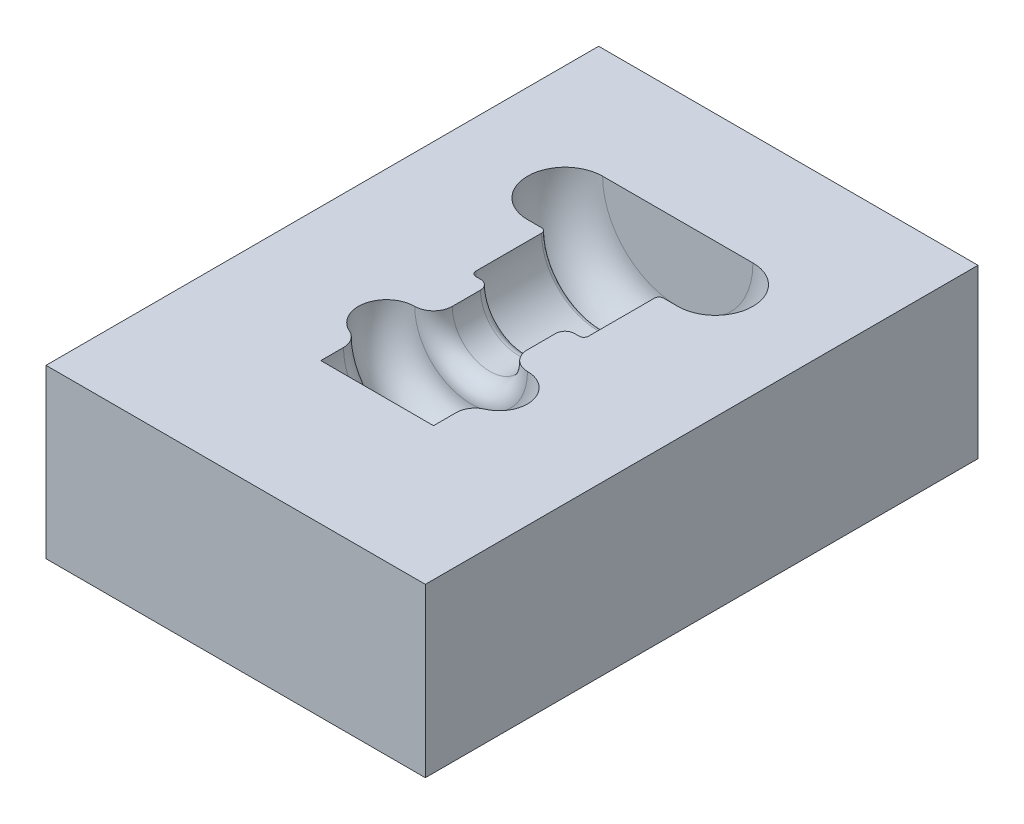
ISO-10303-21;
HEADER;
FILE_DESCRIPTION(('STEP AP214'),'2;1');
FILE_NAME('part.step','',(''),(''),'','','');
FILE_SCHEMA(('AUTOMOTIVE_DESIGN { 1 0 10303 214 1 1 1 1 }'));
ENDSEC;
DATA;
#1=APPLICATION_CONTEXT('core data for automotive mechanical design processes');
#2=APPLICATION_PROTOCOL_DEFINITION('international standard','automotive_design',2000,#1);
#3=PRODUCT_CONTEXT('',#1,'mechanical');
#4=PRODUCT('Part','Part','',(#3));
#5=PRODUCT_RELATED_PRODUCT_CATEGORY('part','',(#4));
#6=PRODUCT_DEFINITION_FORMATION('','',#4);
#7=PRODUCT_DEFINITION_CONTEXT('part definition',#1,'design');
#8=PRODUCT_DEFINITION('design','',#6,#7);
#9=PRODUCT_DEFINITION_SHAPE('','',#8);
#10=(LENGTH_UNIT() NAMED_UNIT(*) SI_UNIT(.MILLI.,.METRE.));
#11=(NAMED_UNIT(*) PLANE_ANGLE_UNIT() SI_UNIT($,.RADIAN.));
#12=(NAMED_UNIT(*) SI_UNIT($,.STERADIAN.) SOLID_ANGLE_UNIT());
#13=UNCERTAINTY_MEASURE_WITH_UNIT(LENGTH_MEASURE(1.E-05),#10,'distance_accuracy_value','');
#14=(GEOMETRIC_REPRESENTATION_CONTEXT(3) GLOBAL_UNCERTAINTY_ASSIGNED_CONTEXT((#13)) GLOBAL_UNIT_ASSIGNED_CONTEXT((#10,
#11,#12)) REPRESENTATION_CONTEXT('',''));
#15=CARTESIAN_POINT('',(0.,0.,0.));
#16=DIRECTION('',(0.,0.,1.));
#17=DIRECTION('',(1.,0.,0.));
#18=AXIS2_PLACEMENT_3D('',#15,#16,#17);
#19=CARTESIAN_POINT('',(-127.309952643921,0.,-0.01000000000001));
#20=DIRECTION('',(0.,-1.,0.));
#21=DIRECTION('',(0.,0.,-1.));
#22=AXIS2_PLACEMENT_3D('',#19,#20,#21);
#23=PLANE('',#22);
#24=CARTESIAN_POINT('',(40.8,0.,80.4000000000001));
#25=DIRECTION('',(0.,-1.,0.));
#26=DIRECTION('',(0.,0.,-1.));
#27=AXIS2_PLACEMENT_3D('',#24,#25,#26);
#28=CIRCLE('',#27,20.4);
#29=CARTESIAN_POINT('',(40.8,0.,100.8));
#30=VERTEX_POINT('',#29);
#31=CARTESIAN_POINT('',(40.8,0.,60.0000000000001));
#32=VERTEX_POINT('',#31);
#33=EDGE_CURVE('E221',#30,#32,#28,.F.);
#34=ORIENTED_EDGE('',*,*,#33,.F.);
#35=DIRECTION('',(1.,0.,0.));
#36=VECTOR('',#35,1.);
#37=CARTESIAN_POINT('',(40.8,0.,100.8));
#38=LINE('',#37,#36);
#39=CARTESIAN_POINT('',(33.15,0.,100.8));
#40=VERTEX_POINT('',#39);
#41=EDGE_CURVE('E218',#40,#30,#38,.T.);
#42=ORIENTED_EDGE('',*,*,#41,.F.);
#43=CARTESIAN_POINT('',(33.15,0.,103.35));
#44=DIRECTION('',(0.,-1.,0.));
#45=DIRECTION('',(0.,0.,-1.));
#46=AXIS2_PLACEMENT_3D('',#43,#44,#45);
#47=CIRCLE('',#46,2.55);
#48=CARTESIAN_POINT('',(30.6,0.,103.35));
#49=VERTEX_POINT('',#48);
#50=EDGE_CURVE('E214',#49,#40,#47,.T.);
#51=ORIENTED_EDGE('',*,*,#50,.F.);
#52=DIRECTION('',(0.,0.,-1.));
#53=VECTOR('',#52,1.);
#54=CARTESIAN_POINT('',(30.6,0.,60.0000000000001));
#55=LINE('',#54,#53);
#56=CARTESIAN_POINT('',(30.6,0.,139.05));
#57=VERTEX_POINT('',#56);
#58=EDGE_CURVE('E210',#57,#49,#55,.T.);
#59=ORIENTED_EDGE('',*,*,#58,.F.);
#60=CARTESIAN_POINT('',(28.05,0.,139.05));
#61=DIRECTION('',(0.,-1.,0.));
#62=DIRECTION('',(0.,0.,-1.));
#63=AXIS2_PLACEMENT_3D('',#60,#61,#62);
#64=CIRCLE('',#63,2.55);
#65=CARTESIAN_POINT('',(28.05,0.,141.6));
#66=VERTEX_POINT('',#65);
#67=EDGE_CURVE('E206',#66,#57,#64,.F.);
#68=ORIENTED_EDGE('',*,*,#67,.F.);
#69=DIRECTION('',(1.,0.,0.));
#70=VECTOR('',#69,1.);
#71=CARTESIAN_POINT('',(28.05,0.,141.6));
#72=LINE('',#71,#70);
#73=CARTESIAN_POINT('',(25.5,0.,141.6));
#74=VERTEX_POINT('',#73);
#75=EDGE_CURVE('E203',#74,#66,#72,.T.);
#76=ORIENTED_EDGE('',*,*,#75,.F.);
#77=CARTESIAN_POINT('',(25.5,0.,146.7));
#78=DIRECTION('',(0.,-1.,0.));
#79=DIRECTION('',(0.,0.,-1.));
#80=AXIS2_PLACEMENT_3D('',#77,#78,#79);
#81=CIRCLE('',#80,5.1);
#82=CARTESIAN_POINT('',(20.4,0.,146.7));
#83=VERTEX_POINT('',#82);
#84=EDGE_CURVE('E199',#83,#74,#81,.T.);
#85=ORIENTED_EDGE('',*,*,#84,.F.);
#86=DIRECTION('',(0.,0.,-1.));
#87=VECTOR('',#86,1.);
#88=CARTESIAN_POINT('',(20.4,0.,60.0000000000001));
#89=LINE('',#88,#87);
#90=CARTESIAN_POINT('',(20.4,0.,162.));
#91=VERTEX_POINT('',#90);
#92=EDGE_CURVE('E195',#91,#83,#89,.T.);
#93=ORIENTED_EDGE('',*,*,#92,.F.);
#94=CARTESIAN_POINT('',(30.6,0.,162.));
#95=DIRECTION('',(0.,-1.,0.));
#96=DIRECTION('',(0.,0.,-1.));
#97=AXIS2_PLACEMENT_3D('',#94,#95,#96);
#98=CIRCLE('',#97,10.2);
#99=CARTESIAN_POINT('',(30.6,0.,172.2));
#100=VERTEX_POINT('',#99);
#101=EDGE_CURVE('E191',#100,#91,#98,.T.);
#102=ORIENTED_EDGE('',*,*,#101,.F.);
#103=CARTESIAN_POINT('',(30.6,0.,187.5));
#104=DIRECTION('',(0.,-1.,0.));
#105=DIRECTION('',(0.,0.,-1.));
#106=AXIS2_PLACEMENT_3D('',#103,#104,#105);
#107=CIRCLE('',#106,15.3);
#108=CARTESIAN_POINT('',(36.72,0.,201.522681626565));
#109=VERTEX_POINT('',#108);
#110=EDGE_CURVE('E187',#109,#100,#107,.F.);
#111=ORIENTED_EDGE('',*,*,#110,.F.);
#112=CARTESIAN_POINT('',(40.8,0.,210.871136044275));
#113=DIRECTION('',(0.,-1.,0.));
#114=DIRECTION('',(0.,0.,-1.));
#115=AXIS2_PLACEMENT_3D('',#112,#113,#114);
#116=CIRCLE('',#115,10.2);
#117=CARTESIAN_POINT('',(30.6,0.,210.871136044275));
#118=VERTEX_POINT('',#117);
#119=EDGE_CURVE('E183',#118,#109,#116,.T.);
#120=ORIENTED_EDGE('',*,*,#119,.F.);
#121=DIRECTION('',(0.,0.,-1.));
#122=VECTOR('',#121,1.);
#123=CARTESIAN_POINT('',(30.6,0.,60.0000000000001));
#124=LINE('',#123,#122);
#125=CARTESIAN_POINT('',(30.6,0.,223.2));
#126=VERTEX_POINT('',#125);
#127=EDGE_CURVE('E178',#126,#118,#124,.T.);
#128=ORIENTED_EDGE('',*,*,#127,.F.);
#129=DIRECTION('',(1.,0.,0.));
#130=VECTOR('',#129,1.);
#131=CARTESIAN_POINT('',(10.2,0.,223.2));
#132=LINE('',#131,#130);
#133=CARTESIAN_POINT('',(-30.6,0.,223.2));
#134=VERTEX_POINT('',#133);
#135=EDGE_CURVE('E163',#134,#126,#132,.T.);
#136=ORIENTED_EDGE('',*,*,#135,.F.);
#137=DIRECTION('',(0.,0.,-1.));
#138=VECTOR('',#137,1.);
#139=CARTESIAN_POINT('',(-30.6,0.,60.0000000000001));
#140=LINE('',#139,#138);
#141=CARTESIAN_POINT('',(-30.6,0.,210.871136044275));
#142=VERTEX_POINT('',#141);
#143=EDGE_CURVE('E181',#142,#134,#140,.F.);
#144=ORIENTED_EDGE('',*,*,#143,.F.);
#145=CARTESIAN_POINT('',(-40.8,0.,210.871136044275));
#146=DIRECTION('',(0.,-1.,0.));
#147=DIRECTION('',(0.,0.,-1.));
#148=AXIS2_PLACEMENT_3D('',#145,#146,#147);
#149=CIRCLE('',#148,10.2);
#150=CARTESIAN_POINT('',(-36.72,0.,201.522681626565));
#151=VERTEX_POINT('',#150);
#152=EDGE_CURVE('E185',#151,#142,#149,.T.);
#153=ORIENTED_EDGE('',*,*,#152,.F.);
#154=CARTESIAN_POINT('',(-30.6,0.,187.5));
#155=DIRECTION('',(0.,-1.,0.));
#156=DIRECTION('',(0.,0.,-1.));
#157=AXIS2_PLACEMENT_3D('',#154,#155,#156);
#158=CIRCLE('',#157,15.3);
#159=CARTESIAN_POINT('',(-30.6,0.,172.2));
#160=VERTEX_POINT('',#159);
#161=EDGE_CURVE('E189',#160,#151,#158,.F.);
#162=ORIENTED_EDGE('',*,*,#161,.F.);
#163=CARTESIAN_POINT('',(-30.6,0.,162.));
#164=DIRECTION('',(0.,-1.,0.));
#165=DIRECTION('',(0.,0.,-1.));
#166=AXIS2_PLACEMENT_3D('',#163,#164,#165);
#167=CIRCLE('',#166,10.2);
#168=CARTESIAN_POINT('',(-20.4,0.,162.));
#169=VERTEX_POINT('',#168);
#170=EDGE_CURVE('E193',#169,#160,#167,.T.);
#171=ORIENTED_EDGE('',*,*,#170,.F.);
#172=DIRECTION('',(0.,0.,-1.));
#173=VECTOR('',#172,1.);
#174=CARTESIAN_POINT('',(-20.4,0.,60.0000000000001));
#175=LINE('',#174,#173);
#176=CARTESIAN_POINT('',(-20.4,0.,146.7));
#177=VERTEX_POINT('',#176);
#178=EDGE_CURVE('E197',#177,#169,#175,.F.);
#179=ORIENTED_EDGE('',*,*,#178,.F.);
#180=CARTESIAN_POINT('',(-25.5,0.,146.7));
#181=DIRECTION('',(0.,-1.,0.));
#182=DIRECTION('',(0.,0.,-1.));
#183=AXIS2_PLACEMENT_3D('',#180,#181,#182);
#184=CIRCLE('',#183,5.1);
#185=CARTESIAN_POINT('',(-25.5,0.,141.6));
#186=VERTEX_POINT('',#185);
#187=EDGE_CURVE('E201',#186,#177,#184,.T.);
#188=ORIENTED_EDGE('',*,*,#187,.F.);
#189=CARTESIAN_POINT('',(-28.05,0.,141.6));
#190=VERTEX_POINT('',#189);
#191=EDGE_CURVE('E204',#190,#186,#72,.T.);
#192=ORIENTED_EDGE('',*,*,#191,.F.);
#193=CARTESIAN_POINT('',(-28.05,0.,139.05));
#194=DIRECTION('',(0.,-1.,0.));
#195=DIRECTION('',(0.,0.,-1.));
#196=AXIS2_PLACEMENT_3D('',#193,#194,#195);
#197=CIRCLE('',#196,2.55);
#198=CARTESIAN_POINT('',(-30.6,0.,139.05));
#199=VERTEX_POINT('',#198);
#200=EDGE_CURVE('E208',#199,#190,#197,.F.);
#201=ORIENTED_EDGE('',*,*,#200,.F.);
#202=DIRECTION('',(0.,0.,-1.));
#203=VECTOR('',#202,1.);
#204=CARTESIAN_POINT('',(-30.6,0.,60.0000000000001));
#205=LINE('',#204,#203);
#206=CARTESIAN_POINT('',(-30.6,0.,103.35));
#207=VERTEX_POINT('',#206);
#208=EDGE_CURVE('E212',#207,#199,#205,.F.);
#209=ORIENTED_EDGE('',*,*,#208,.F.);
#210=CARTESIAN_POINT('',(-33.15,0.,103.35));
#211=DIRECTION('',(0.,-1.,0.));
#212=DIRECTION('',(0.,0.,-1.));
#213=AXIS2_PLACEMENT_3D('',#210,#211,#212);
#214=CIRCLE('',#213,2.55);
#215=CARTESIAN_POINT('',(-33.15,0.,100.8));
#216=VERTEX_POINT('',#215);
#217=EDGE_CURVE('E216',#216,#207,#214,.T.);
#218=ORIENTED_EDGE('',*,*,#217,.F.);
#219=CARTESIAN_POINT('',(-40.8,0.,100.8));
#220=VERTEX_POINT('',#219);
#221=EDGE_CURVE('E219',#220,#216,#38,.T.);
#222=ORIENTED_EDGE('',*,*,#221,.F.);
#223=CARTESIAN_POINT('',(-40.8,0.,80.4000000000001));
#224=DIRECTION('',(0.,-1.,0.));
#225=DIRECTION('',(0.,0.,-1.));
#226=AXIS2_PLACEMENT_3D('',#223,#224,#225);
#227=CIRCLE('',#226,20.4);
#228=CARTESIAN_POINT('',(-40.8,0.,60.0000000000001));
#229=VERTEX_POINT('',#228);
#230=EDGE_CURVE('E224',#229,#220,#227,.F.);
#231=ORIENTED_EDGE('',*,*,#230,.F.);
#232=DIRECTION('',(-1.,0.,0.));
#233=VECTOR('',#232,1.);
#234=CARTESIAN_POINT('',(0.,0.,60.0000000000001));
#235=LINE('',#234,#233);
#236=EDGE_CURVE('E226',#32,#229,#235,.T.);
#237=ORIENTED_EDGE('',*,*,#236,.F.);
#238=EDGE_LOOP('',(#34,#42,#51,#59,#68,#76,#85,#93,#102,#111,#120,#128,#136,#144,#153,#162,#171,
#179,#188,#192,#201,#209,#218,#222,#231,#237));
#239=FACE_BOUND('',#238,.T.);
#240=DIRECTION('',(1.,0.,0.));
#241=VECTOR('',#240,1.);
#242=CARTESIAN_POINT('',(0.,0.,0.));
#243=LINE('',#242,#241);
#244=CARTESIAN_POINT('',(-102.966766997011,0.,0.));
#245=VERTEX_POINT('',#244);
#246=CARTESIAN_POINT('',(102.966766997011,0.,0.));
#247=VERTEX_POINT('',#246);
#248=EDGE_CURVE('E228',#245,#247,#243,.T.);
#249=ORIENTED_EDGE('',*,*,#248,.F.);
#250=DIRECTION('',(0.,0.,-1.));
#251=VECTOR('',#250,1.);
#252=CARTESIAN_POINT('',(-102.966766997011,0.,300.));
#253=LINE('',#252,#251);
#254=CARTESIAN_POINT('',(-102.966766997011,0.,300.));
#255=VERTEX_POINT('',#254);
#256=EDGE_CURVE('E230',#255,#245,#253,.T.);
#257=ORIENTED_EDGE('',*,*,#256,.F.);
#258=DIRECTION('',(1.,0.,0.));
#259=VECTOR('',#258,1.);
#260=CARTESIAN_POINT('',(0.,0.,300.));
#261=LINE('',#260,#259);
#262=CARTESIAN_POINT('',(102.966766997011,0.,300.));
#263=VERTEX_POINT('',#262);
#264=EDGE_CURVE('E11',#255,#263,#261,.T.);
#265=ORIENTED_EDGE('',*,*,#264,.T.);
#266=DIRECTION('',(0.,0.,1.));
#267=VECTOR('',#266,1.);
#268=CARTESIAN_POINT('',(102.966766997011,0.,300.));
#269=LINE('',#268,#267);
#270=EDGE_CURVE('E35',#247,#263,#269,.T.);
#271=ORIENTED_EDGE('',*,*,#270,.F.);
#272=EDGE_LOOP('',(#249,#257,#265,#271));
#273=FACE_BOUND('',#272,.T.);
#274=ADVANCED_FACE('F32',(#239,#273),#23,.F.);
#275=CARTESIAN_POINT('',(0.,0.,60.0000000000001));
#276=DIRECTION('',(0.,0.,-1.));
#277=DIRECTION('',(0.,1.,0.));
#278=AXIS2_PLACEMENT_3D('',#275,#276,#277);
#279=PLANE('',#278);
#280=CARTESIAN_POINT('',(0.,0.,60.0000000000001));
#281=DIRECTION('',(0.,0.,-1.));
#282=DIRECTION('',(0.,1.,0.));
#283=AXIS2_PLACEMENT_3D('',#280,#281,#282);
#284=CIRCLE('',#283,40.8);
#285=EDGE_CURVE('E174',#32,#229,#284,.T.);
#286=ORIENTED_EDGE('',*,*,#285,.F.);
#287=ORIENTED_EDGE('',*,*,#236,.T.);
#288=EDGE_LOOP('',(#286,#287));
#289=FACE_BOUND('',#288,.T.);
#290=ADVANCED_FACE('F341',(#289),#279,.F.);
#291=CARTESIAN_POINT('',(0.,0.,80.4000000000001));
#292=DIRECTION('',(0.,0.,-1.));
#293=DIRECTION('',(0.,1.,0.));
#294=AXIS2_PLACEMENT_3D('',#291,#292,#293);
#295=TOROIDAL_SURFACE('',#294,40.8,20.4);
#296=ORIENTED_EDGE('',*,*,#285,.T.);
#297=ORIENTED_EDGE('',*,*,#230,.T.);
#298=CARTESIAN_POINT('',(0.,0.,100.8));
#299=DIRECTION('',(0.,0.,-1.));
#300=DIRECTION('',(0.,1.,0.));
#301=AXIS2_PLACEMENT_3D('',#298,#299,#300);
#302=CIRCLE('',#301,40.8);
#303=EDGE_CURVE('E240',#30,#220,#302,.T.);
#304=ORIENTED_EDGE('',*,*,#303,.F.);
#305=ORIENTED_EDGE('',*,*,#33,.T.);
#306=EDGE_LOOP('',(#296,#297,#304,#305));
#307=FACE_BOUND('',#306,.T.);
#308=ADVANCED_FACE('F339',(#307),#295,.F.);
#309=CARTESIAN_POINT('',(40.8,0.,100.8));
#310=DIRECTION('',(0.,0.,1.));
#311=DIRECTION('',(0.,-1.,0.));
#312=AXIS2_PLACEMENT_3D('',#309,#310,#311);
#313=PLANE('',#312);
#314=ORIENTED_EDGE('',*,*,#303,.T.);
#315=ORIENTED_EDGE('',*,*,#221,.T.);
#316=CARTESIAN_POINT('',(0.,0.,100.8));
#317=DIRECTION('',(0.,0.,-1.));
#318=DIRECTION('',(0.,1.,0.));
#319=AXIS2_PLACEMENT_3D('',#316,#317,#318);
#320=CIRCLE('',#319,33.15);
#321=EDGE_CURVE('E243',#40,#216,#320,.T.);
#322=ORIENTED_EDGE('',*,*,#321,.F.);
#323=ORIENTED_EDGE('',*,*,#41,.T.);
#324=EDGE_LOOP('',(#314,#315,#322,#323));
#325=FACE_BOUND('',#324,.T.);
#326=ADVANCED_FACE('F334',(#325),#313,.F.);
#327=CARTESIAN_POINT('',(0.,0.,103.35));
#328=DIRECTION('',(0.,0.,-1.));
#329=DIRECTION('',(0.,1.,0.));
#330=AXIS2_PLACEMENT_3D('',#327,#328,#329);
#331=TOROIDAL_SURFACE('',#330,33.15,2.55);
#332=ORIENTED_EDGE('',*,*,#321,.T.);
#333=ORIENTED_EDGE('',*,*,#217,.T.);
#334=CARTESIAN_POINT('',(0.,0.,103.35));
#335=DIRECTION('',(0.,0.,-1.));
#336=DIRECTION('',(0.,1.,0.));
#337=AXIS2_PLACEMENT_3D('',#334,#335,#336);
#338=CIRCLE('',#337,30.6);
#339=EDGE_CURVE('E246',#49,#207,#338,.T.);
#340=ORIENTED_EDGE('',*,*,#339,.F.);
#341=ORIENTED_EDGE('',*,*,#50,.T.);
#342=EDGE_LOOP('',(#332,#333,#340,#341));
#343=FACE_BOUND('',#342,.T.);
#344=ADVANCED_FACE('F330',(#343),#331,.T.);
#345=CARTESIAN_POINT('',(0.,0.,60.0000000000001));
#346=DIRECTION('',(0.,0.,-1.));
#347=DIRECTION('',(0.,1.,0.));
#348=AXIS2_PLACEMENT_3D('',#345,#346,#347);
#349=CYLINDRICAL_SURFACE('',#348,30.6);
#350=ORIENTED_EDGE('',*,*,#339,.T.);
#351=ORIENTED_EDGE('',*,*,#208,.T.);
#352=CARTESIAN_POINT('',(0.,0.,139.05));
#353=DIRECTION('',(0.,0.,-1.));
#354=DIRECTION('',(0.,1.,0.));
#355=AXIS2_PLACEMENT_3D('',#352,#353,#354);
#356=CIRCLE('',#355,30.6);
#357=EDGE_CURVE('E249',#57,#199,#356,.T.);
#358=ORIENTED_EDGE('',*,*,#357,.F.);
#359=ORIENTED_EDGE('',*,*,#58,.T.);
#360=EDGE_LOOP('',(#350,#351,#358,#359));
#361=FACE_BOUND('',#360,.T.);
#362=ADVANCED_FACE('F327',(#361),#349,.F.);
#363=CARTESIAN_POINT('',(0.,0.,139.05));
#364=DIRECTION('',(0.,0.,-1.));
#365=DIRECTION('',(0.,1.,0.));
#366=AXIS2_PLACEMENT_3D('',#363,#364,#365);
#367=TOROIDAL_SURFACE('',#366,28.05,2.55);
#368=ORIENTED_EDGE('',*,*,#357,.T.);
#369=ORIENTED_EDGE('',*,*,#200,.T.);
#370=CARTESIAN_POINT('',(0.,0.,141.6));
#371=DIRECTION('',(0.,0.,-1.));
#372=DIRECTION('',(0.,1.,0.));
#373=AXIS2_PLACEMENT_3D('',#370,#371,#372);
#374=CIRCLE('',#373,28.05);
#375=EDGE_CURVE('E252',#66,#190,#374,.T.);
#376=ORIENTED_EDGE('',*,*,#375,.F.);
#377=ORIENTED_EDGE('',*,*,#67,.T.);
#378=EDGE_LOOP('',(#368,#369,#376,#377));
#379=FACE_BOUND('',#378,.T.);
#380=ADVANCED_FACE('F319',(#379),#367,.F.);
#381=CARTESIAN_POINT('',(28.05,0.,141.6));
#382=DIRECTION('',(0.,0.,1.));
#383=DIRECTION('',(0.,-1.,0.));
#384=AXIS2_PLACEMENT_3D('',#381,#382,#383);
#385=PLANE('',#384);
#386=ORIENTED_EDGE('',*,*,#375,.T.);
#387=ORIENTED_EDGE('',*,*,#191,.T.);
#388=CARTESIAN_POINT('',(0.,0.,141.6));
#389=DIRECTION('',(0.,0.,-1.));
#390=DIRECTION('',(0.,1.,0.));
#391=AXIS2_PLACEMENT_3D('',#388,#389,#390);
#392=CIRCLE('',#391,25.5);
#393=EDGE_CURVE('E255',#74,#186,#392,.T.);
#394=ORIENTED_EDGE('',*,*,#393,.F.);
#395=ORIENTED_EDGE('',*,*,#75,.T.);
#396=EDGE_LOOP('',(#386,#387,#394,#395));
#397=FACE_BOUND('',#396,.T.);
#398=ADVANCED_FACE('F315',(#397),#385,.F.);
#399=CARTESIAN_POINT('',(0.,0.,146.7));
#400=DIRECTION('',(0.,0.,-1.));
#401=DIRECTION('',(0.,1.,0.));
#402=AXIS2_PLACEMENT_3D('',#399,#400,#401);
#403=TOROIDAL_SURFACE('',#402,25.5,5.1);
#404=ORIENTED_EDGE('',*,*,#393,.T.);
#405=ORIENTED_EDGE('',*,*,#187,.T.);
#406=CARTESIAN_POINT('',(0.,0.,146.7));
#407=DIRECTION('',(0.,0.,-1.));
#408=DIRECTION('',(0.,1.,0.));
#409=AXIS2_PLACEMENT_3D('',#406,#407,#408);
#410=CIRCLE('',#409,20.4);
#411=EDGE_CURVE('E258',#83,#177,#410,.T.);
#412=ORIENTED_EDGE('',*,*,#411,.F.);
#413=ORIENTED_EDGE('',*,*,#84,.T.);
#414=EDGE_LOOP('',(#404,#405,#412,#413));
#415=FACE_BOUND('',#414,.T.);
#416=ADVANCED_FACE('F312',(#415),#403,.T.);
#417=CARTESIAN_POINT('',(0.,0.,60.0000000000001));
#418=DIRECTION('',(0.,0.,-1.));
#419=DIRECTION('',(0.,1.,0.));
#420=AXIS2_PLACEMENT_3D('',#417,#418,#419);
#421=CYLINDRICAL_SURFACE('',#420,20.4);
#422=ORIENTED_EDGE('',*,*,#411,.T.);
#423=ORIENTED_EDGE('',*,*,#178,.T.);
#424=CARTESIAN_POINT('',(0.,0.,162.));
#425=DIRECTION('',(0.,0.,-1.));
#426=DIRECTION('',(0.,1.,0.));
#427=AXIS2_PLACEMENT_3D('',#424,#425,#426);
#428=CIRCLE('',#427,20.4);
#429=EDGE_CURVE('E261',#91,#169,#428,.T.);
#430=ORIENTED_EDGE('',*,*,#429,.F.);
#431=ORIENTED_EDGE('',*,*,#92,.T.);
#432=EDGE_LOOP('',(#422,#423,#430,#431));
#433=FACE_BOUND('',#432,.T.);
#434=ADVANCED_FACE('F304',(#433),#421,.F.);
#435=CARTESIAN_POINT('',(0.,0.,162.));
#436=DIRECTION('',(0.,0.,-1.));
#437=DIRECTION('',(0.,1.,0.));
#438=AXIS2_PLACEMENT_3D('',#435,#436,#437);
#439=TOROIDAL_SURFACE('',#438,30.6,10.2);
#440=ORIENTED_EDGE('',*,*,#429,.T.);
#441=ORIENTED_EDGE('',*,*,#170,.T.);
#442=CARTESIAN_POINT('',(0.,0.,172.2));
#443=DIRECTION('',(0.,0.,-1.));
#444=DIRECTION('',(0.,1.,0.));
#445=AXIS2_PLACEMENT_3D('',#442,#443,#444);
#446=CIRCLE('',#445,30.6);
#447=EDGE_CURVE('E264',#100,#160,#446,.T.);
#448=ORIENTED_EDGE('',*,*,#447,.F.);
#449=ORIENTED_EDGE('',*,*,#101,.T.);
#450=EDGE_LOOP('',(#440,#441,#448,#449));
#451=FACE_BOUND('',#450,.T.);
#452=ADVANCED_FACE('F300',(#451),#439,.T.);
#453=CARTESIAN_POINT('',(0.,0.,187.5));
#454=DIRECTION('',(0.,0.,-1.));
#455=DIRECTION('',(0.,1.,0.));
#456=AXIS2_PLACEMENT_3D('',#453,#454,#455);
#457=TOROIDAL_SURFACE('',#456,30.6,15.3);
#458=ORIENTED_EDGE('',*,*,#447,.T.);
#459=ORIENTED_EDGE('',*,*,#161,.T.);
#460=CARTESIAN_POINT('',(0.,0.,201.522681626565));
#461=DIRECTION('',(0.,0.,-1.));
#462=DIRECTION('',(0.,1.,0.));
#463=AXIS2_PLACEMENT_3D('',#460,#461,#462);
#464=CIRCLE('',#463,36.72);
#465=EDGE_CURVE('E267',#109,#151,#464,.T.);
#466=ORIENTED_EDGE('',*,*,#465,.F.);
#467=ORIENTED_EDGE('',*,*,#110,.T.);
#468=EDGE_LOOP('',(#458,#459,#466,#467));
#469=FACE_BOUND('',#468,.T.);
#470=ADVANCED_FACE('F298',(#469),#457,.F.);
#471=CARTESIAN_POINT('',(0.,0.,210.871136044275));
#472=DIRECTION('',(0.,0.,-1.));
#473=DIRECTION('',(0.,1.,0.));
#474=AXIS2_PLACEMENT_3D('',#471,#472,#473);
#475=TOROIDAL_SURFACE('',#474,40.8,10.2);
#476=ORIENTED_EDGE('',*,*,#465,.T.);
#477=ORIENTED_EDGE('',*,*,#152,.T.);
#478=CARTESIAN_POINT('',(0.,0.,210.871136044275));
#479=DIRECTION('',(0.,0.,-1.));
#480=DIRECTION('',(0.,1.,0.));
#481=AXIS2_PLACEMENT_3D('',#478,#479,#480);
#482=CIRCLE('',#481,30.6);
#483=EDGE_CURVE('E270',#118,#142,#482,.T.);
#484=ORIENTED_EDGE('',*,*,#483,.F.);
#485=ORIENTED_EDGE('',*,*,#119,.T.);
#486=EDGE_LOOP('',(#476,#477,#484,#485));
#487=FACE_BOUND('',#486,.T.);
#488=ADVANCED_FACE('F292',(#487),#475,.T.);
#489=CARTESIAN_POINT('',(0.,0.,60.0000000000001));
#490=DIRECTION('',(0.,0.,-1.));
#491=DIRECTION('',(0.,1.,0.));
#492=AXIS2_PLACEMENT_3D('',#489,#490,#491);
#493=CYLINDRICAL_SURFACE('',#492,30.6);
#494=ORIENTED_EDGE('',*,*,#483,.T.);
#495=ORIENTED_EDGE('',*,*,#143,.T.);
#496=CARTESIAN_POINT('',(0.,0.,223.2));
#497=DIRECTION('',(0.,0.,-1.));
#498=DIRECTION('',(0.,1.,0.));
#499=AXIS2_PLACEMENT_3D('',#496,#497,#498);
#500=CIRCLE('',#499,30.6);
#501=EDGE_CURVE('E273',#126,#134,#500,.T.);
#502=ORIENTED_EDGE('',*,*,#501,.F.);
#503=ORIENTED_EDGE('',*,*,#127,.T.);
#504=EDGE_LOOP('',(#494,#495,#502,#503));
#505=FACE_BOUND('',#504,.T.);
#506=ADVANCED_FACE('F281',(#505),#493,.F.);
#507=CARTESIAN_POINT('',(10.2,0.,223.2));
#508=DIRECTION('',(0.,0.,1.));
#509=DIRECTION('',(0.,-1.,0.));
#510=AXIS2_PLACEMENT_3D('',#507,#508,#509);
#511=PLANE('',#510);
#512=ORIENTED_EDGE('',*,*,#501,.T.);
#513=ORIENTED_EDGE('',*,*,#135,.T.);
#514=EDGE_LOOP('',(#512,#513));
#515=FACE_BOUND('',#514,.T.);
#516=ADVANCED_FACE('F277',(#515),#511,.F.);
#517=CARTESIAN_POINT('',(-102.966766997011,-90.934066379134,300.));
#518=DIRECTION('',(0.,1.,0.));
#519=DIRECTION('',(-1.,0.,0.));
#520=AXIS2_PLACEMENT_3D('',#517,#518,#519);
#521=PLANE('',#520);
#522=DIRECTION('',(1.,0.,0.));
#523=VECTOR('',#522,1.);
#524=CARTESIAN_POINT('',(-102.966766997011,-90.934066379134,0.));
#525=LINE('',#524,#523);
#526=CARTESIAN_POINT('',(-102.966766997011,-90.934066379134,0.));
#527=VERTEX_POINT('',#526);
#528=CARTESIAN_POINT('',(102.966766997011,-90.934066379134,0.));
#529=VERTEX_POINT('',#528);
#530=EDGE_CURVE('E176',#527,#529,#525,.T.);
#531=ORIENTED_EDGE('',*,*,#530,.T.);
#532=DIRECTION('',(0.,0.,-1.));
#533=VECTOR('',#532,1.);
#534=CARTESIAN_POINT('',(102.966766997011,-90.934066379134,300.));
#535=LINE('',#534,#533);
#536=CARTESIAN_POINT('',(102.966766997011,-90.934066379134,300.));
#537=VERTEX_POINT('',#536);
#538=EDGE_CURVE('E164',#537,#529,#535,.T.);
#539=ORIENTED_EDGE('',*,*,#538,.F.);
#540=DIRECTION('',(1.,0.,0.));
#541=VECTOR('',#540,1.);
#542=CARTESIAN_POINT('',(-102.966766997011,-90.934066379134,300.));
#543=LINE('',#542,#541);
#544=CARTESIAN_POINT('',(-102.966766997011,-90.934066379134,300.));
#545=VERTEX_POINT('',#544);
#546=EDGE_CURVE('E151',#545,#537,#543,.T.);
#547=ORIENTED_EDGE('',*,*,#546,.F.);
#548=DIRECTION('',(0.,0.,-1.));
#549=VECTOR('',#548,1.);
#550=CARTESIAN_POINT('',(-102.966766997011,-90.934066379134,300.));
#551=LINE('',#550,#549);
#552=EDGE_CURVE('E157',#545,#527,#551,.T.);
#553=ORIENTED_EDGE('',*,*,#552,.T.);
#554=EDGE_LOOP('',(#531,#539,#547,#553));
#555=FACE_BOUND('',#554,.T.);
#556=ADVANCED_FACE('F166',(#555),#521,.F.);
#557=CARTESIAN_POINT('',(102.966766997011,90.934066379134,300.));
#558=DIRECTION('',(-1.,0.,0.));
#559=DIRECTION('',(0.,0.,1.));
#560=AXIS2_PLACEMENT_3D('',#557,#558,#559);
#561=PLANE('',#560);
#562=DIRECTION('',(0.,1.,0.));
#563=VECTOR('',#562,1.);
#564=CARTESIAN_POINT('',(102.966766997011,90.934066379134,0.));
#565=LINE('',#564,#563);
#566=EDGE_CURVE('E172',#529,#247,#565,.T.);
#567=ORIENTED_EDGE('',*,*,#566,.T.);
#568=ORIENTED_EDGE('',*,*,#270,.T.);
#569=DIRECTION('',(0.,1.,0.));
#570=VECTOR('',#569,1.);
#571=CARTESIAN_POINT('',(102.966766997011,90.934066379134,300.));
#572=LINE('',#571,#570);
#573=EDGE_CURVE('E154',#537,#263,#572,.T.);
#574=ORIENTED_EDGE('',*,*,#573,.F.);
#575=ORIENTED_EDGE('',*,*,#538,.T.);
#576=EDGE_LOOP('',(#567,#568,#574,#575));
#577=FACE_BOUND('',#576,.T.);
#578=ADVANCED_FACE('F236',(#577),#561,.F.);
#579=CARTESIAN_POINT('',(-102.966766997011,90.934066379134,300.));
#580=DIRECTION('',(1.,0.,0.));
#581=DIRECTION('',(0.,0.,-1.));
#582=AXIS2_PLACEMENT_3D('',#579,#580,#581);
#583=PLANE('',#582);
#584=DIRECTION('',(0.,-1.,0.));
#585=VECTOR('',#584,1.);
#586=CARTESIAN_POINT('',(-102.966766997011,90.934066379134,300.));
#587=LINE('',#586,#585);
#588=EDGE_CURVE('E147',#255,#545,#587,.T.);
#589=ORIENTED_EDGE('',*,*,#588,.F.);
#590=ORIENTED_EDGE('',*,*,#256,.T.);
#591=DIRECTION('',(0.,-1.,0.));
#592=VECTOR('',#591,1.);
#593=CARTESIAN_POINT('',(-102.966766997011,90.934066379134,0.));
#594=LINE('',#593,#592);
#595=EDGE_CURVE('E160',#245,#527,#594,.T.);
#596=ORIENTED_EDGE('',*,*,#595,.T.);
#597=ORIENTED_EDGE('',*,*,#552,.F.);
#598=EDGE_LOOP('',(#589,#590,#596,#597));
#599=FACE_BOUND('',#598,.T.);
#600=ADVANCED_FACE('F158',(#599),#583,.F.);
#601=CARTESIAN_POINT('',(0.,0.,0.));
#602=DIRECTION('',(0.,0.,1.));
#603=DIRECTION('',(1.,0.,0.));
#604=AXIS2_PLACEMENT_3D('',#601,#602,#603);
#605=PLANE('',#604);
#606=ORIENTED_EDGE('',*,*,#595,.F.);
#607=ORIENTED_EDGE('',*,*,#248,.T.);
#608=ORIENTED_EDGE('',*,*,#566,.F.);
#609=ORIENTED_EDGE('',*,*,#530,.F.);
#610=EDGE_LOOP('',(#606,#607,#608,#609));
#611=FACE_BOUND('',#610,.T.);
#612=ADVANCED_FACE('F235',(#611),#605,.F.);
#613=CARTESIAN_POINT('',(0.,0.,300.));
#614=DIRECTION('',(0.,0.,1.));
#615=DIRECTION('',(1.,0.,0.));
#616=AXIS2_PLACEMENT_3D('',#613,#614,#615);
#617=PLANE('',#616);
#618=ORIENTED_EDGE('',*,*,#264,.F.);
#619=ORIENTED_EDGE('',*,*,#588,.T.);
#620=ORIENTED_EDGE('',*,*,#546,.T.);
#621=ORIENTED_EDGE('',*,*,#573,.T.);
#622=EDGE_LOOP('',(#618,#619,#620,#621));
#623=FACE_BOUND('',#622,.T.);
#624=ADVANCED_FACE('F149',(#623),#617,.T.);
#625=CLOSED_SHELL('',(#274,#290,#308,#326,#344,#362,#380,#398,#416,#434,#452,#470,#488,#506,
#516,#556,#578,#600,#612,#624));
#626=MANIFOLD_SOLID_BREP('B2',#625);
#627=ADVANCED_BREP_SHAPE_REPRESENTATION('',(#18,#626),#14);
#628=SHAPE_DEFINITION_REPRESENTATION(#9,#627);
ENDSEC;
END-ISO-10303-21;
